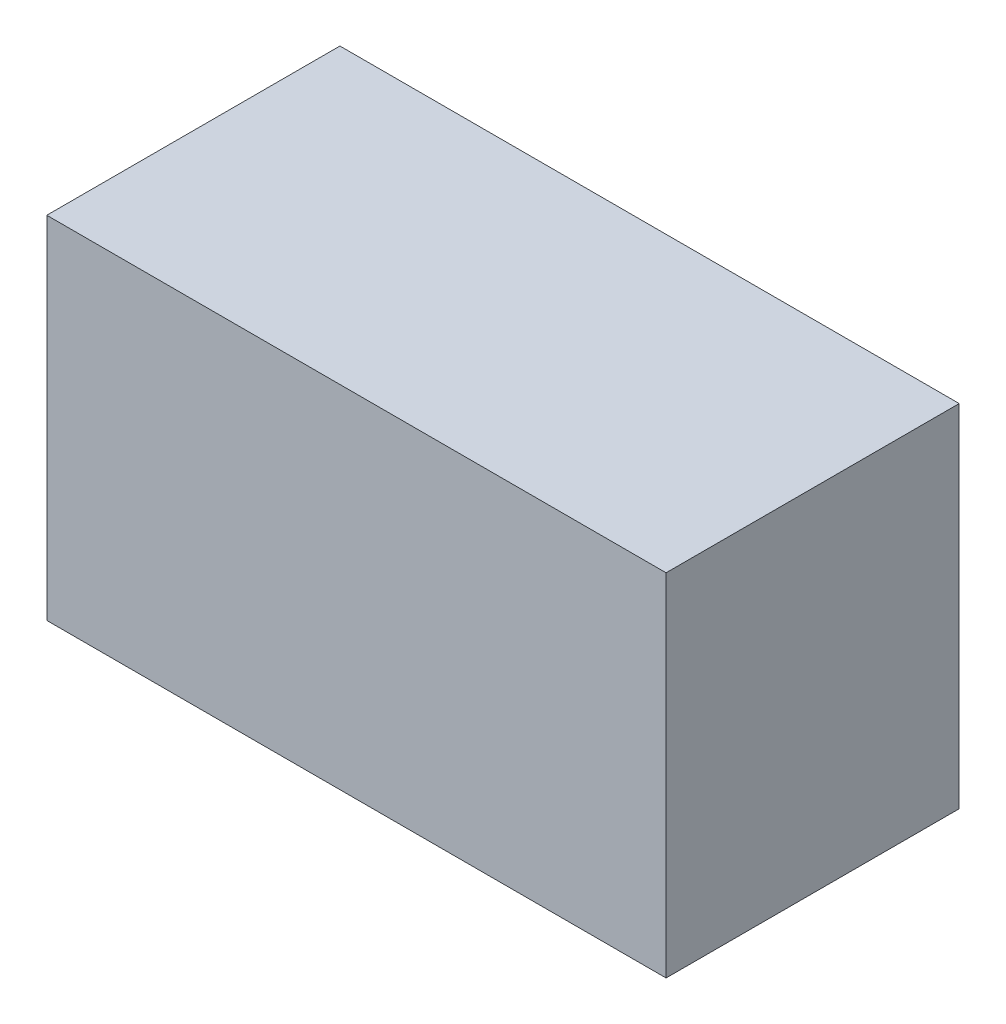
ISO-10303-21;
HEADER;
FILE_DESCRIPTION(('STEP AP214'),'2;1');
FILE_NAME('part.step','',(''),(''),'','','');
FILE_SCHEMA(('AUTOMOTIVE_DESIGN { 1 0 10303 214 1 1 1 1 }'));
ENDSEC;
DATA;
#1=APPLICATION_CONTEXT('core data for automotive mechanical design processes');
#2=APPLICATION_PROTOCOL_DEFINITION('international standard','automotive_design',2000,#1);
#3=PRODUCT_CONTEXT('',#1,'mechanical');
#4=PRODUCT('Part','Part','',(#3));
#5=PRODUCT_RELATED_PRODUCT_CATEGORY('part','',(#4));
#6=PRODUCT_DEFINITION_FORMATION('','',#4);
#7=PRODUCT_DEFINITION_CONTEXT('part definition',#1,'design');
#8=PRODUCT_DEFINITION('design','',#6,#7);
#9=PRODUCT_DEFINITION_SHAPE('','',#8);
#10=(LENGTH_UNIT() NAMED_UNIT(*) SI_UNIT(.MILLI.,.METRE.));
#11=(NAMED_UNIT(*) PLANE_ANGLE_UNIT() SI_UNIT($,.RADIAN.));
#12=(NAMED_UNIT(*) SI_UNIT($,.STERADIAN.) SOLID_ANGLE_UNIT());
#13=UNCERTAINTY_MEASURE_WITH_UNIT(LENGTH_MEASURE(1.E-05),#10,'distance_accuracy_value','');
#14=(GEOMETRIC_REPRESENTATION_CONTEXT(3) GLOBAL_UNCERTAINTY_ASSIGNED_CONTEXT((#13)) GLOBAL_UNIT_ASSIGNED_CONTEXT((#10,
#11,#12)) REPRESENTATION_CONTEXT('',''));
#15=CARTESIAN_POINT('',(0.,0.,0.));
#16=DIRECTION('',(0.,0.,1.));
#17=DIRECTION('',(1.,0.,0.));
#18=AXIS2_PLACEMENT_3D('',#15,#16,#17);
#19=CARTESIAN_POINT('',(-15.,8.5,7.1));
#20=DIRECTION('',(1.,0.,0.));
#21=DIRECTION('',(0.,0.,-1.));
#22=AXIS2_PLACEMENT_3D('',#19,#20,#21);
#23=PLANE('',#22);
#24=DIRECTION('',(0.,-1.,0.));
#25=VECTOR('',#24,1.);
#26=CARTESIAN_POINT('',(-15.,8.5,-7.1));
#27=LINE('',#26,#25);
#28=CARTESIAN_POINT('',(-15.,8.5,-7.1));
#29=VERTEX_POINT('',#28);
#30=CARTESIAN_POINT('',(-15.,-8.5,-7.1));
#31=VERTEX_POINT('',#30);
#32=EDGE_CURVE('E61',#29,#31,#27,.T.);
#33=ORIENTED_EDGE('',*,*,#32,.T.);
#34=DIRECTION('',(0.,0.,-1.));
#35=VECTOR('',#34,1.);
#36=CARTESIAN_POINT('',(-15.,-8.5,7.1));
#37=LINE('',#36,#35);
#38=CARTESIAN_POINT('',(-15.,-8.5,7.1));
#39=VERTEX_POINT('',#38);
#40=EDGE_CURVE('E11',#39,#31,#37,.T.);
#41=ORIENTED_EDGE('',*,*,#40,.F.);
#42=DIRECTION('',(0.,-1.,0.));
#43=VECTOR('',#42,1.);
#44=CARTESIAN_POINT('',(-15.,8.5,7.1));
#45=LINE('',#44,#43);
#46=CARTESIAN_POINT('',(-15.,8.5,7.1));
#47=VERTEX_POINT('',#46);
#48=EDGE_CURVE('E84',#47,#39,#45,.T.);
#49=ORIENTED_EDGE('',*,*,#48,.F.);
#50=DIRECTION('',(0.,0.,-1.));
#51=VECTOR('',#50,1.);
#52=CARTESIAN_POINT('',(-15.,8.5,7.1));
#53=LINE('',#52,#51);
#54=EDGE_CURVE('E74',#47,#29,#53,.T.);
#55=ORIENTED_EDGE('',*,*,#54,.T.);
#56=EDGE_LOOP('',(#33,#41,#49,#55));
#57=FACE_BOUND('',#56,.T.);
#58=ADVANCED_FACE('F17',(#57),#23,.F.);
#59=CARTESIAN_POINT('',(-15.,-8.5,7.1));
#60=DIRECTION('',(0.,1.,0.));
#61=DIRECTION('',(0.,0.,1.));
#62=AXIS2_PLACEMENT_3D('',#59,#60,#61);
#63=PLANE('',#62);
#64=DIRECTION('',(1.,0.,0.));
#65=VECTOR('',#64,1.);
#66=CARTESIAN_POINT('',(-15.,-8.5,-7.1));
#67=LINE('',#66,#65);
#68=CARTESIAN_POINT('',(15.,-8.5,-7.1));
#69=VERTEX_POINT('',#68);
#70=EDGE_CURVE('E57',#31,#69,#67,.T.);
#71=ORIENTED_EDGE('',*,*,#70,.T.);
#72=DIRECTION('',(0.,0.,-1.));
#73=VECTOR('',#72,1.);
#74=CARTESIAN_POINT('',(15.,-8.5,7.1));
#75=LINE('',#74,#73);
#76=CARTESIAN_POINT('',(15.,-8.5,7.1));
#77=VERTEX_POINT('',#76);
#78=EDGE_CURVE('E24',#77,#69,#75,.T.);
#79=ORIENTED_EDGE('',*,*,#78,.F.);
#80=DIRECTION('',(1.,0.,0.));
#81=VECTOR('',#80,1.);
#82=CARTESIAN_POINT('',(-15.,-8.5,7.1));
#83=LINE('',#82,#81);
#84=EDGE_CURVE('E70',#39,#77,#83,.T.);
#85=ORIENTED_EDGE('',*,*,#84,.F.);
#86=ORIENTED_EDGE('',*,*,#40,.T.);
#87=EDGE_LOOP('',(#71,#79,#85,#86));
#88=FACE_BOUND('',#87,.T.);
#89=ADVANCED_FACE('F69',(#88),#63,.F.);
#90=CARTESIAN_POINT('',(15.,-8.5,7.1));
#91=DIRECTION('',(-1.,0.,0.));
#92=DIRECTION('',(0.,-1.,0.));
#93=AXIS2_PLACEMENT_3D('',#90,#91,#92);
#94=PLANE('',#93);
#95=DIRECTION('',(0.,1.,0.));
#96=VECTOR('',#95,1.);
#97=CARTESIAN_POINT('',(15.,-8.5,-7.1));
#98=LINE('',#97,#96);
#99=CARTESIAN_POINT('',(15.,8.5,-7.1));
#100=VERTEX_POINT('',#99);
#101=EDGE_CURVE('E62',#69,#100,#98,.T.);
#102=ORIENTED_EDGE('',*,*,#101,.T.);
#103=DIRECTION('',(0.,0.,-1.));
#104=VECTOR('',#103,1.);
#105=CARTESIAN_POINT('',(15.,8.5,7.1));
#106=LINE('',#105,#104);
#107=CARTESIAN_POINT('',(15.,8.5,7.1));
#108=VERTEX_POINT('',#107);
#109=EDGE_CURVE('E89',#108,#100,#106,.T.);
#110=ORIENTED_EDGE('',*,*,#109,.F.);
#111=DIRECTION('',(0.,1.,0.));
#112=VECTOR('',#111,1.);
#113=CARTESIAN_POINT('',(15.,-8.5,7.1));
#114=LINE('',#113,#112);
#115=EDGE_CURVE('E36',#77,#108,#114,.T.);
#116=ORIENTED_EDGE('',*,*,#115,.F.);
#117=ORIENTED_EDGE('',*,*,#78,.T.);
#118=EDGE_LOOP('',(#102,#110,#116,#117));
#119=FACE_BOUND('',#118,.T.);
#120=ADVANCED_FACE('F92',(#119),#94,.F.);
#121=CARTESIAN_POINT('',(15.,8.5,7.1));
#122=DIRECTION('',(0.,-1.,0.));
#123=DIRECTION('',(1.,0.,0.));
#124=AXIS2_PLACEMENT_3D('',#121,#122,#123);
#125=PLANE('',#124);
#126=DIRECTION('',(-1.,0.,0.));
#127=VECTOR('',#126,1.);
#128=CARTESIAN_POINT('',(15.,8.5,-7.1));
#129=LINE('',#128,#127);
#130=EDGE_CURVE('E81',#100,#29,#129,.T.);
#131=ORIENTED_EDGE('',*,*,#130,.T.);
#132=ORIENTED_EDGE('',*,*,#54,.F.);
#133=DIRECTION('',(-1.,0.,0.));
#134=VECTOR('',#133,1.);
#135=CARTESIAN_POINT('',(15.,8.5,7.1));
#136=LINE('',#135,#134);
#137=EDGE_CURVE('E31',#108,#47,#136,.T.);
#138=ORIENTED_EDGE('',*,*,#137,.F.);
#139=ORIENTED_EDGE('',*,*,#109,.T.);
#140=EDGE_LOOP('',(#131,#132,#138,#139));
#141=FACE_BOUND('',#140,.T.);
#142=ADVANCED_FACE('F94',(#141),#125,.F.);
#143=CARTESIAN_POINT('',(-15.,-8.5,7.1));
#144=DIRECTION('',(0.,0.,1.));
#145=DIRECTION('',(1.,0.,0.));
#146=AXIS2_PLACEMENT_3D('',#143,#144,#145);
#147=PLANE('',#146);
#148=ORIENTED_EDGE('',*,*,#48,.T.);
#149=ORIENTED_EDGE('',*,*,#84,.T.);
#150=ORIENTED_EDGE('',*,*,#115,.T.);
#151=ORIENTED_EDGE('',*,*,#137,.T.);
#152=EDGE_LOOP('',(#148,#149,#150,#151));
#153=FACE_BOUND('',#152,.T.);
#154=ADVANCED_FACE('F95',(#153),#147,.T.);
#155=CARTESIAN_POINT('',(-15.,-8.5,-7.1));
#156=DIRECTION('',(0.,0.,1.));
#157=DIRECTION('',(1.,0.,0.));
#158=AXIS2_PLACEMENT_3D('',#155,#156,#157);
#159=PLANE('',#158);
#160=ORIENTED_EDGE('',*,*,#32,.F.);
#161=ORIENTED_EDGE('',*,*,#130,.F.);
#162=ORIENTED_EDGE('',*,*,#101,.F.);
#163=ORIENTED_EDGE('',*,*,#70,.F.);
#164=EDGE_LOOP('',(#160,#161,#162,#163));
#165=FACE_BOUND('',#164,.T.);
#166=ADVANCED_FACE('F58',(#165),#159,.F.);
#167=CLOSED_SHELL('',(#58,#89,#120,#142,#154,#166));
#168=MANIFOLD_SOLID_BREP('B1',#167);
#169=ADVANCED_BREP_SHAPE_REPRESENTATION('',(#18,#168),#14);
#170=SHAPE_DEFINITION_REPRESENTATION(#9,#169);
ENDSEC;
END-ISO-10303-21;
